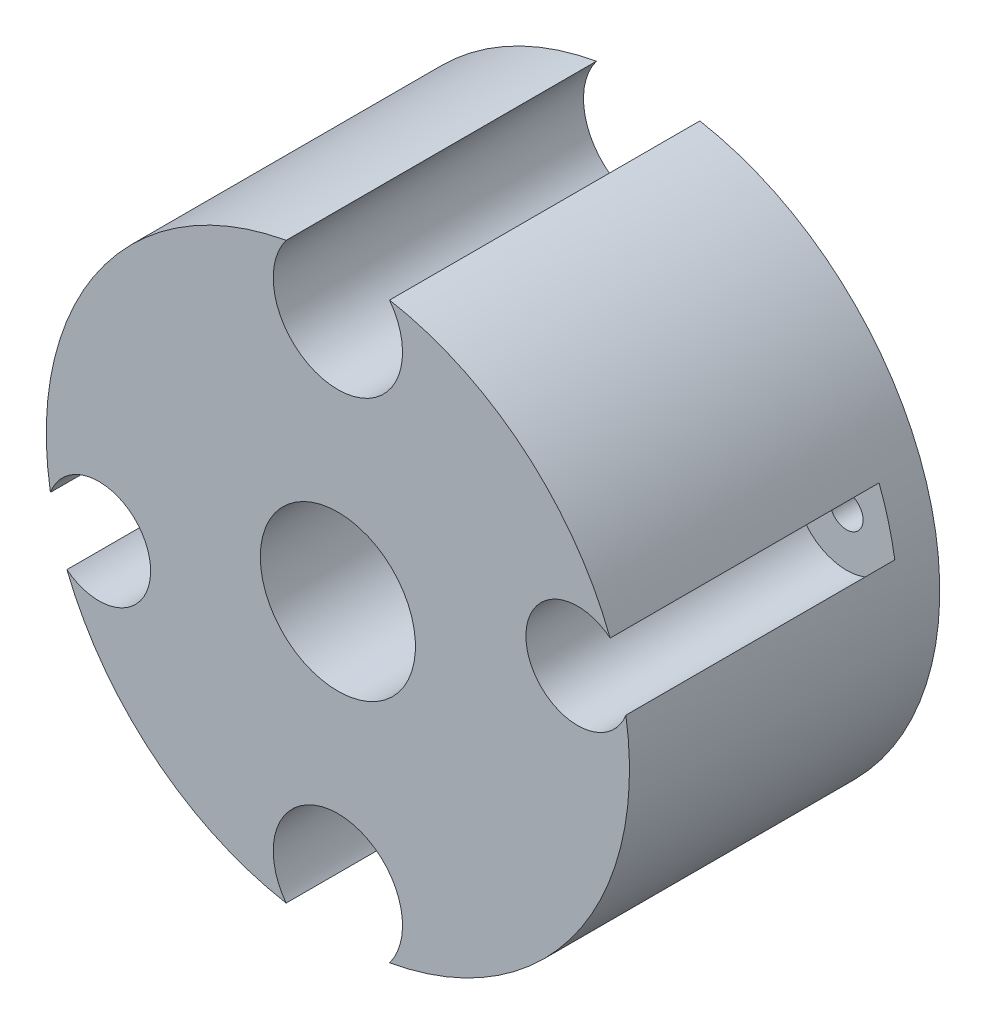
ISO-10303-21;
HEADER;
FILE_DESCRIPTION(('STEP AP214'),'2;1');
FILE_NAME('part.step','',(''),(''),'','','');
FILE_SCHEMA(('AUTOMOTIVE_DESIGN { 1 0 10303 214 1 1 1 1 }'));
ENDSEC;
DATA;
#1=APPLICATION_CONTEXT('core data for automotive mechanical design processes');
#2=APPLICATION_PROTOCOL_DEFINITION('international standard','automotive_design',2000,#1);
#3=PRODUCT_CONTEXT('',#1,'mechanical');
#4=PRODUCT('Part','Part','',(#3));
#5=PRODUCT_RELATED_PRODUCT_CATEGORY('part','',(#4));
#6=PRODUCT_DEFINITION_FORMATION('','',#4);
#7=PRODUCT_DEFINITION_CONTEXT('part definition',#1,'design');
#8=PRODUCT_DEFINITION('design','',#6,#7);
#9=PRODUCT_DEFINITION_SHAPE('','',#8);
#10=(LENGTH_UNIT() NAMED_UNIT(*) SI_UNIT(.MILLI.,.METRE.));
#11=(NAMED_UNIT(*) PLANE_ANGLE_UNIT() SI_UNIT($,.RADIAN.));
#12=(NAMED_UNIT(*) SI_UNIT($,.STERADIAN.) SOLID_ANGLE_UNIT());
#13=UNCERTAINTY_MEASURE_WITH_UNIT(LENGTH_MEASURE(1.E-05),#10,'distance_accuracy_value','');
#14=(GEOMETRIC_REPRESENTATION_CONTEXT(3) GLOBAL_UNCERTAINTY_ASSIGNED_CONTEXT((#13)) GLOBAL_UNIT_ASSIGNED_CONTEXT((#10,
#11,#12)) REPRESENTATION_CONTEXT('',''));
#15=CARTESIAN_POINT('',(0.,0.,0.));
#16=DIRECTION('',(0.,0.,1.));
#17=DIRECTION('',(1.,0.,0.));
#18=AXIS2_PLACEMENT_3D('',#15,#16,#17);
#19=CARTESIAN_POINT('',(0.,0.,19.05));
#20=DIRECTION('',(0.,0.,-1.));
#21=DIRECTION('',(-1.,0.,0.));
#22=AXIS2_PLACEMENT_3D('',#19,#20,#21);
#23=CYLINDRICAL_SURFACE('',#22,4.7625);
#24=CARTESIAN_POINT('',(0.,0.,8.25500000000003));
#25=DIRECTION('',(0.,0.,-1.));
#26=DIRECTION('',(-1.,0.,0.));
#27=AXIS2_PLACEMENT_3D('',#24,#25,#26);
#28=CIRCLE('',#27,4.7625);
#29=CARTESIAN_POINT('',(-4.7625,0.,8.25500000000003));
#30=VERTEX_POINT('',#29);
#31=EDGE_CURVE('E11',#30,#30,#28,.T.);
#32=CARTESIAN_POINT('',(0.,0.,19.05));
#33=DIRECTION('',(0.,0.,1.));
#34=DIRECTION('',(1.,0.,0.));
#35=AXIS2_PLACEMENT_3D('',#32,#33,#34);
#36=CIRCLE('',#35,4.7625);
#37=CARTESIAN_POINT('',(-4.7625,0.,19.05));
#38=VERTEX_POINT('',#37);
#39=EDGE_CURVE('E170',#38,#38,#36,.T.);
#40=CARTESIAN_POINT('',(-4.7625,0.,8.25500000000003));
#41=CARTESIAN_POINT('',(-4.7625,0.,8.3674479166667));
#42=CARTESIAN_POINT('',(-4.7625,0.,8.47989583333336));
#43=CARTESIAN_POINT('',(-4.7625,0.,8.7047916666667));
#44=CARTESIAN_POINT('',(-4.7625,0.,8.81723958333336));
#45=CARTESIAN_POINT('',(-4.7625,0.,9.0421354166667));
#46=CARTESIAN_POINT('',(-4.7625,0.,9.15458333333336));
#47=CARTESIAN_POINT('',(-4.7625,0.,9.37947916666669));
#48=CARTESIAN_POINT('',(-4.7625,0.,9.49192708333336));
#49=CARTESIAN_POINT('',(-4.7625,0.,9.71682291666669));
#50=CARTESIAN_POINT('',(-4.7625,0.,9.82927083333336));
#51=CARTESIAN_POINT('',(-4.7625,0.,10.0541666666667));
#52=CARTESIAN_POINT('',(-4.7625,0.,10.1666145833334));
#53=CARTESIAN_POINT('',(-4.7625,0.,10.3915104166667));
#54=CARTESIAN_POINT('',(-4.7625,0.,10.5039583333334));
#55=CARTESIAN_POINT('',(-4.7625,0.,10.7288541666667));
#56=CARTESIAN_POINT('',(-4.7625,0.,10.8413020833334));
#57=CARTESIAN_POINT('',(-4.7625,0.,11.0661979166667));
#58=CARTESIAN_POINT('',(-4.7625,0.,11.1786458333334));
#59=CARTESIAN_POINT('',(-4.7625,0.,11.4035416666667));
#60=CARTESIAN_POINT('',(-4.7625,0.,11.5159895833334));
#61=CARTESIAN_POINT('',(-4.7625,0.,11.7408854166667));
#62=CARTESIAN_POINT('',(-4.7625,0.,11.8533333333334));
#63=CARTESIAN_POINT('',(-4.7625,0.,12.0782291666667));
#64=CARTESIAN_POINT('',(-4.7625,0.,12.1906770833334));
#65=CARTESIAN_POINT('',(-4.7625,0.,12.4155729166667));
#66=CARTESIAN_POINT('',(-4.7625,0.,12.5280208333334));
#67=CARTESIAN_POINT('',(-4.7625,0.,12.7529166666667));
#68=CARTESIAN_POINT('',(-4.7625,0.,12.8653645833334));
#69=CARTESIAN_POINT('',(-4.7625,0.,13.0902604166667));
#70=CARTESIAN_POINT('',(-4.7625,0.,13.2027083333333));
#71=CARTESIAN_POINT('',(-4.7625,0.,13.4276041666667));
#72=CARTESIAN_POINT('',(-4.7625,0.,13.5400520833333));
#73=CARTESIAN_POINT('',(-4.7625,0.,13.7649479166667));
#74=CARTESIAN_POINT('',(-4.7625,0.,13.8773958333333));
#75=CARTESIAN_POINT('',(-4.7625,0.,14.1022916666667));
#76=CARTESIAN_POINT('',(-4.7625,0.,14.2147395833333));
#77=CARTESIAN_POINT('',(-4.7625,0.,14.4396354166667));
#78=CARTESIAN_POINT('',(-4.7625,0.,14.5520833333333));
#79=CARTESIAN_POINT('',(-4.7625,0.,14.7769791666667));
#80=CARTESIAN_POINT('',(-4.7625,0.,14.8894270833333));
#81=CARTESIAN_POINT('',(-4.7625,0.,15.1143229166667));
#82=CARTESIAN_POINT('',(-4.7625,0.,15.2267708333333));
#83=CARTESIAN_POINT('',(-4.7625,0.,15.4516666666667));
#84=CARTESIAN_POINT('',(-4.7625,0.,15.5641145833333));
#85=CARTESIAN_POINT('',(-4.7625,0.,15.7890104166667));
#86=CARTESIAN_POINT('',(-4.7625,0.,15.9014583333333));
#87=CARTESIAN_POINT('',(-4.7625,0.,16.1263541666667));
#88=CARTESIAN_POINT('',(-4.7625,0.,16.2388020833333));
#89=CARTESIAN_POINT('',(-4.7625,0.,16.4636979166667));
#90=CARTESIAN_POINT('',(-4.7625,0.,16.5761458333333));
#91=CARTESIAN_POINT('',(-4.7625,0.,16.8010416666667));
#92=CARTESIAN_POINT('',(-4.7625,0.,16.9134895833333));
#93=CARTESIAN_POINT('',(-4.7625,0.,17.1383854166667));
#94=CARTESIAN_POINT('',(-4.7625,0.,17.2508333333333));
#95=CARTESIAN_POINT('',(-4.7625,0.,17.4757291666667));
#96=CARTESIAN_POINT('',(-4.7625,0.,17.5881770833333));
#97=CARTESIAN_POINT('',(-4.7625,0.,17.8130729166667));
#98=CARTESIAN_POINT('',(-4.7625,0.,17.9255208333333));
#99=CARTESIAN_POINT('',(-4.7625,0.,18.1504166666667));
#100=CARTESIAN_POINT('',(-4.7625,0.,18.2628645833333));
#101=CARTESIAN_POINT('',(-4.7625,0.,18.4877604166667));
#102=CARTESIAN_POINT('',(-4.7625,0.,18.6002083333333));
#103=CARTESIAN_POINT('',(-4.7625,0.,18.8251041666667));
#104=CARTESIAN_POINT('',(-4.7625,0.,18.9375520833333));
#105=CARTESIAN_POINT('',(-4.7625,0.,19.05));
#106=B_SPLINE_CURVE_WITH_KNOTS('',3,(#40,#41,#42,#43,#44,#45,#46,#47,#48,#49,#50,#51,#52,#53,
#54,#55,#56,#57,#58,#59,#60,#61,#62,#63,#64,#65,#66,#67,#68,#69,#70,#71,#72,#73,#74,#75,#76,#77,
#78,#79,#80,#81,#82,#83,#84,#85,#86,#87,#88,#89,#90,#91,#92,#93,#94,#95,#96,#97,#98,#99,#100,
#101,#102,#103,#104,#105),.UNSPECIFIED.,.F.,.F.,(4,2,2,2,2,2,2,2,2,2,2,2,2,2,2,2,2,2,2,2,2,2,2,
2,2,2,2,2,2,2,2,2,4),(0.,0.337343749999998,0.674687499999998,1.01203125,1.349375,
1.68671874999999,2.02406249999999,2.36140624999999,2.69874999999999,3.03609374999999,
3.37343749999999,3.71078124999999,4.04812499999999,4.38546874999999,4.72281249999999,
5.06015624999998,5.39749999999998,5.73484374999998,6.07218749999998,6.40953124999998,
6.74687499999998,7.08421874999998,7.42156249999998,7.75890624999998,8.09624999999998,
8.43359374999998,8.77093749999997,9.10828124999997,9.44562499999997,9.78296874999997,10.1203125,
10.45765625,10.795),.UNSPECIFIED.);
#107=EDGE_CURVE('BSEAM35',#30,#38,#106,.T.);
#108=ORIENTED_EDGE('',*,*,#31,.T.);
#109=ORIENTED_EDGE('',*,*,#39,.T.);
#110=ORIENTED_EDGE('',*,*,#107,.T.);
#111=ORIENTED_EDGE('',*,*,#107,.F.);
#112=EDGE_LOOP('',(#108,#110,#109,#111));
#113=FACE_BOUND('',#112,.T.);
#114=ADVANCED_FACE('F35',(#113),#23,.F.);
#115=CARTESIAN_POINT('',(14.7207095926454,3.94440224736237,19.05));
#116=DIRECTION('',(0.,0.,-1.));
#117=DIRECTION('',(-1.,0.,0.));
#118=AXIS2_PLACEMENT_3D('',#115,#116,#117);
#119=CYLINDRICAL_SURFACE('',#118,1.016);
#120=CARTESIAN_POINT('',(14.7207095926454,3.94440224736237,0.));
#121=DIRECTION('',(0.,0.,1.));
#122=DIRECTION('',(1.,0.,0.));
#123=AXIS2_PLACEMENT_3D('',#120,#121,#122);
#124=CIRCLE('',#123,1.016);
#125=CARTESIAN_POINT('',(13.7047095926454,3.94440224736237,0.));
#126=VERTEX_POINT('',#125);
#127=EDGE_CURVE('E167',#126,#126,#124,.T.);
#128=CARTESIAN_POINT('',(14.7207095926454,3.94440224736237,2.54));
#129=DIRECTION('',(0.,0.,1.));
#130=DIRECTION('',(1.,0.,0.));
#131=AXIS2_PLACEMENT_3D('',#128,#129,#130);
#132=CIRCLE('',#131,1.016);
#133=CARTESIAN_POINT('',(13.7047095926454,3.94440224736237,2.54));
#134=VERTEX_POINT('',#133);
#135=EDGE_CURVE('E154',#134,#134,#132,.T.);
#136=CARTESIAN_POINT('',(13.7047095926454,3.94440224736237,0.));
#137=CARTESIAN_POINT('',(13.7047095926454,3.94440224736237,0.0264583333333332));
#138=CARTESIAN_POINT('',(13.7047095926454,3.94440224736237,0.0529166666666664));
#139=CARTESIAN_POINT('',(13.7047095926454,3.94440224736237,0.105833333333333));
#140=CARTESIAN_POINT('',(13.7047095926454,3.94440224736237,0.132291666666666));
#141=CARTESIAN_POINT('',(13.7047095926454,3.94440224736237,0.185208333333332));
#142=CARTESIAN_POINT('',(13.7047095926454,3.94440224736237,0.211666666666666));
#143=CARTESIAN_POINT('',(13.7047095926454,3.94440224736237,0.264583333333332));
#144=CARTESIAN_POINT('',(13.7047095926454,3.94440224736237,0.291041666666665));
#145=CARTESIAN_POINT('',(13.7047095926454,3.94440224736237,0.343958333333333));
#146=CARTESIAN_POINT('',(13.7047095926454,3.94440224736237,0.370416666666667));
#147=CARTESIAN_POINT('',(13.7047095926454,3.94440224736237,0.423333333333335));
#148=CARTESIAN_POINT('',(13.7047095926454,3.94440224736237,0.449791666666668));
#149=CARTESIAN_POINT('',(13.7047095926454,3.94440224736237,0.502708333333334));
#150=CARTESIAN_POINT('',(13.7047095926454,3.94440224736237,0.529166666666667));
#151=CARTESIAN_POINT('',(13.7047095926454,3.94440224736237,0.582083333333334));
#152=CARTESIAN_POINT('',(13.7047095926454,3.94440224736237,0.608541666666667));
#153=CARTESIAN_POINT('',(13.7047095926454,3.94440224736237,0.661458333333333));
#154=CARTESIAN_POINT('',(13.7047095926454,3.94440224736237,0.687916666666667));
#155=CARTESIAN_POINT('',(13.7047095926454,3.94440224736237,0.740833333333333));
#156=CARTESIAN_POINT('',(13.7047095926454,3.94440224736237,0.767291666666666));
#157=CARTESIAN_POINT('',(13.7047095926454,3.94440224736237,0.820208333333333));
#158=CARTESIAN_POINT('',(13.7047095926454,3.94440224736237,0.846666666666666));
#159=CARTESIAN_POINT('',(13.7047095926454,3.94440224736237,0.899583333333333));
#160=CARTESIAN_POINT('',(13.7047095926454,3.94440224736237,0.926041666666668));
#161=CARTESIAN_POINT('',(13.7047095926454,3.94440224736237,0.978958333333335));
#162=CARTESIAN_POINT('',(13.7047095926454,3.94440224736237,1.00541666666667));
#163=CARTESIAN_POINT('',(13.7047095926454,3.94440224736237,1.05833333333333));
#164=CARTESIAN_POINT('',(13.7047095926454,3.94440224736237,1.08479166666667));
#165=CARTESIAN_POINT('',(13.7047095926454,3.94440224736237,1.13770833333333));
#166=CARTESIAN_POINT('',(13.7047095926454,3.94440224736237,1.16416666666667));
#167=CARTESIAN_POINT('',(13.7047095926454,3.94440224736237,1.21708333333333));
#168=CARTESIAN_POINT('',(13.7047095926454,3.94440224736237,1.24354166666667));
#169=CARTESIAN_POINT('',(13.7047095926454,3.94440224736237,1.29645833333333));
#170=CARTESIAN_POINT('',(13.7047095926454,3.94440224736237,1.32291666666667));
#171=CARTESIAN_POINT('',(13.7047095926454,3.94440224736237,1.37583333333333));
#172=CARTESIAN_POINT('',(13.7047095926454,3.94440224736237,1.40229166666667));
#173=CARTESIAN_POINT('',(13.7047095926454,3.94440224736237,1.45520833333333));
#174=CARTESIAN_POINT('',(13.7047095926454,3.94440224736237,1.48166666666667));
#175=CARTESIAN_POINT('',(13.7047095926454,3.94440224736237,1.53458333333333));
#176=CARTESIAN_POINT('',(13.7047095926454,3.94440224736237,1.56104166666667));
#177=CARTESIAN_POINT('',(13.7047095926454,3.94440224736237,1.61395833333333));
#178=CARTESIAN_POINT('',(13.7047095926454,3.94440224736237,1.64041666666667));
#179=CARTESIAN_POINT('',(13.7047095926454,3.94440224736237,1.69333333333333));
#180=CARTESIAN_POINT('',(13.7047095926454,3.94440224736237,1.71979166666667));
#181=CARTESIAN_POINT('',(13.7047095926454,3.94440224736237,1.77270833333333));
#182=CARTESIAN_POINT('',(13.7047095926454,3.94440224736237,1.79916666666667));
#183=CARTESIAN_POINT('',(13.7047095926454,3.94440224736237,1.85208333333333));
#184=CARTESIAN_POINT('',(13.7047095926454,3.94440224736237,1.87854166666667));
#185=CARTESIAN_POINT('',(13.7047095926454,3.94440224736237,1.93145833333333));
#186=CARTESIAN_POINT('',(13.7047095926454,3.94440224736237,1.95791666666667));
#187=CARTESIAN_POINT('',(13.7047095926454,3.94440224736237,2.01083333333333));
#188=CARTESIAN_POINT('',(13.7047095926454,3.94440224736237,2.03729166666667));
#189=CARTESIAN_POINT('',(13.7047095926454,3.94440224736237,2.09020833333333));
#190=CARTESIAN_POINT('',(13.7047095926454,3.94440224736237,2.11666666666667));
#191=CARTESIAN_POINT('',(13.7047095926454,3.94440224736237,2.16958333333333));
#192=CARTESIAN_POINT('',(13.7047095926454,3.94440224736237,2.19604166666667));
#193=CARTESIAN_POINT('',(13.7047095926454,3.94440224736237,2.24895833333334));
#194=CARTESIAN_POINT('',(13.7047095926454,3.94440224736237,2.27541666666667));
#195=CARTESIAN_POINT('',(13.7047095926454,3.94440224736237,2.32833333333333));
#196=CARTESIAN_POINT('',(13.7047095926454,3.94440224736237,2.35479166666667));
#197=CARTESIAN_POINT('',(13.7047095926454,3.94440224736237,2.40770833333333));
#198=CARTESIAN_POINT('',(13.7047095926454,3.94440224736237,2.43416666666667));
#199=CARTESIAN_POINT('',(13.7047095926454,3.94440224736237,2.48708333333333));
#200=CARTESIAN_POINT('',(13.7047095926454,3.94440224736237,2.51354166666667));
#201=CARTESIAN_POINT('',(13.7047095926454,3.94440224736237,2.54));
#202=B_SPLINE_CURVE_WITH_KNOTS('',3,(#136,#137,#138,#139,#140,#141,#142,#143,#144,#145,#146,
#147,#148,#149,#150,#151,#152,#153,#154,#155,#156,#157,#158,#159,#160,#161,#162,#163,#164,#165,
#166,#167,#168,#169,#170,#171,#172,#173,#174,#175,#176,#177,#178,#179,#180,#181,#182,#183,#184,
#185,#186,#187,#188,#189,#190,#191,#192,#193,#194,#195,#196,#197,#198,#199,#200,#201),
.UNSPECIFIED.,.F.,.F.,(4,2,2,2,2,2,2,2,2,2,2,2,2,2,2,2,2,2,2,2,2,2,2,2,2,2,2,2,2,2,2,2,4),(0.,
0.0793749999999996,0.158749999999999,0.238124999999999,0.317499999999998,0.396875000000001,
0.476250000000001,0.555625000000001,0.635,0.714375,0.793749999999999,0.873124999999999,
0.952500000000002,1.031875,1.11125,1.190625,1.27,1.349375,1.42875,1.508125,1.5875,1.666875,
1.74625,1.825625,1.905,1.984375,2.06375,2.143125,2.2225,2.301875,2.38125,2.460625,2.54),.UNSPECIFIED.);
#203=EDGE_CURVE('BSEAM212',#126,#134,#202,.T.);
#204=ORIENTED_EDGE('',*,*,#127,.F.);
#205=ORIENTED_EDGE('',*,*,#135,.T.);
#206=ORIENTED_EDGE('',*,*,#203,.T.);
#207=ORIENTED_EDGE('',*,*,#203,.F.);
#208=EDGE_LOOP('',(#204,#206,#205,#207));
#209=FACE_BOUND('',#208,.T.);
#210=ADVANCED_FACE('F212',(#209),#119,.F.);
#211=CARTESIAN_POINT('',(-14.6713946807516,-4.12404875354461,19.05));
#212=DIRECTION('',(0.,0.,-1.));
#213=DIRECTION('',(-1.,0.,0.));
#214=AXIS2_PLACEMENT_3D('',#211,#212,#213);
#215=CYLINDRICAL_SURFACE('',#214,1.016);
#216=CARTESIAN_POINT('',(-14.6713946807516,-4.12404875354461,0.));
#217=DIRECTION('',(0.,0.,1.));
#218=DIRECTION('',(1.,0.,0.));
#219=AXIS2_PLACEMENT_3D('',#216,#217,#218);
#220=CIRCLE('',#219,1.016);
#221=CARTESIAN_POINT('',(-15.6873946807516,-4.12404875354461,0.));
#222=VERTEX_POINT('',#221);
#223=EDGE_CURVE('E164',#222,#222,#220,.T.);
#224=CARTESIAN_POINT('',(-14.6713946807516,-4.12404875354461,2.54));
#225=DIRECTION('',(0.,0.,1.));
#226=DIRECTION('',(1.,0.,0.));
#227=AXIS2_PLACEMENT_3D('',#224,#225,#226);
#228=CIRCLE('',#227,1.016);
#229=CARTESIAN_POINT('',(-15.6873946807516,-4.12404875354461,2.54));
#230=VERTEX_POINT('',#229);
#231=EDGE_CURVE('E146',#230,#230,#228,.T.);
#232=CARTESIAN_POINT('',(-15.6873946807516,-4.12404875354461,0.));
#233=CARTESIAN_POINT('',(-15.6873946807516,-4.12404875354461,0.0264583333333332));
#234=CARTESIAN_POINT('',(-15.6873946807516,-4.12404875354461,0.0529166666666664));
#235=CARTESIAN_POINT('',(-15.6873946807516,-4.12404875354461,0.105833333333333));
#236=CARTESIAN_POINT('',(-15.6873946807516,-4.12404875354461,0.132291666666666));
#237=CARTESIAN_POINT('',(-15.6873946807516,-4.12404875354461,0.185208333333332));
#238=CARTESIAN_POINT('',(-15.6873946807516,-4.12404875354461,0.211666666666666));
#239=CARTESIAN_POINT('',(-15.6873946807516,-4.12404875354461,0.264583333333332));
#240=CARTESIAN_POINT('',(-15.6873946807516,-4.12404875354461,0.291041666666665));
#241=CARTESIAN_POINT('',(-15.6873946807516,-4.12404875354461,0.343958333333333));
#242=CARTESIAN_POINT('',(-15.6873946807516,-4.12404875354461,0.370416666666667));
#243=CARTESIAN_POINT('',(-15.6873946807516,-4.12404875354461,0.423333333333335));
#244=CARTESIAN_POINT('',(-15.6873946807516,-4.12404875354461,0.449791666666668));
#245=CARTESIAN_POINT('',(-15.6873946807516,-4.12404875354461,0.502708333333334));
#246=CARTESIAN_POINT('',(-15.6873946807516,-4.12404875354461,0.529166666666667));
#247=CARTESIAN_POINT('',(-15.6873946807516,-4.12404875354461,0.582083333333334));
#248=CARTESIAN_POINT('',(-15.6873946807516,-4.12404875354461,0.608541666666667));
#249=CARTESIAN_POINT('',(-15.6873946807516,-4.12404875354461,0.661458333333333));
#250=CARTESIAN_POINT('',(-15.6873946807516,-4.12404875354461,0.687916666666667));
#251=CARTESIAN_POINT('',(-15.6873946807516,-4.12404875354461,0.740833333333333));
#252=CARTESIAN_POINT('',(-15.6873946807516,-4.12404875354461,0.767291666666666));
#253=CARTESIAN_POINT('',(-15.6873946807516,-4.12404875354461,0.820208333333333));
#254=CARTESIAN_POINT('',(-15.6873946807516,-4.12404875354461,0.846666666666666));
#255=CARTESIAN_POINT('',(-15.6873946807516,-4.12404875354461,0.899583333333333));
#256=CARTESIAN_POINT('',(-15.6873946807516,-4.12404875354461,0.926041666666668));
#257=CARTESIAN_POINT('',(-15.6873946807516,-4.12404875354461,0.978958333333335));
#258=CARTESIAN_POINT('',(-15.6873946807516,-4.12404875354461,1.00541666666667));
#259=CARTESIAN_POINT('',(-15.6873946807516,-4.12404875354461,1.05833333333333));
#260=CARTESIAN_POINT('',(-15.6873946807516,-4.12404875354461,1.08479166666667));
#261=CARTESIAN_POINT('',(-15.6873946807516,-4.12404875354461,1.13770833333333));
#262=CARTESIAN_POINT('',(-15.6873946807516,-4.12404875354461,1.16416666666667));
#263=CARTESIAN_POINT('',(-15.6873946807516,-4.12404875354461,1.21708333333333));
#264=CARTESIAN_POINT('',(-15.6873946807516,-4.12404875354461,1.24354166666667));
#265=CARTESIAN_POINT('',(-15.6873946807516,-4.12404875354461,1.29645833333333));
#266=CARTESIAN_POINT('',(-15.6873946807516,-4.12404875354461,1.32291666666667));
#267=CARTESIAN_POINT('',(-15.6873946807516,-4.12404875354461,1.37583333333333));
#268=CARTESIAN_POINT('',(-15.6873946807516,-4.12404875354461,1.40229166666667));
#269=CARTESIAN_POINT('',(-15.6873946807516,-4.12404875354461,1.45520833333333));
#270=CARTESIAN_POINT('',(-15.6873946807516,-4.12404875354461,1.48166666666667));
#271=CARTESIAN_POINT('',(-15.6873946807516,-4.12404875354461,1.53458333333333));
#272=CARTESIAN_POINT('',(-15.6873946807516,-4.12404875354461,1.56104166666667));
#273=CARTESIAN_POINT('',(-15.6873946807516,-4.12404875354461,1.61395833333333));
#274=CARTESIAN_POINT('',(-15.6873946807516,-4.12404875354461,1.64041666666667));
#275=CARTESIAN_POINT('',(-15.6873946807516,-4.12404875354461,1.69333333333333));
#276=CARTESIAN_POINT('',(-15.6873946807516,-4.12404875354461,1.71979166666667));
#277=CARTESIAN_POINT('',(-15.6873946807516,-4.12404875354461,1.77270833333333));
#278=CARTESIAN_POINT('',(-15.6873946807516,-4.12404875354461,1.79916666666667));
#279=CARTESIAN_POINT('',(-15.6873946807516,-4.12404875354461,1.85208333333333));
#280=CARTESIAN_POINT('',(-15.6873946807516,-4.12404875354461,1.87854166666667));
#281=CARTESIAN_POINT('',(-15.6873946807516,-4.12404875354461,1.93145833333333));
#282=CARTESIAN_POINT('',(-15.6873946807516,-4.12404875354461,1.95791666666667));
#283=CARTESIAN_POINT('',(-15.6873946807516,-4.12404875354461,2.01083333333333));
#284=CARTESIAN_POINT('',(-15.6873946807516,-4.12404875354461,2.03729166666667));
#285=CARTESIAN_POINT('',(-15.6873946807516,-4.12404875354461,2.09020833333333));
#286=CARTESIAN_POINT('',(-15.6873946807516,-4.12404875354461,2.11666666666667));
#287=CARTESIAN_POINT('',(-15.6873946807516,-4.12404875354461,2.16958333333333));
#288=CARTESIAN_POINT('',(-15.6873946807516,-4.12404875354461,2.19604166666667));
#289=CARTESIAN_POINT('',(-15.6873946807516,-4.12404875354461,2.24895833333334));
#290=CARTESIAN_POINT('',(-15.6873946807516,-4.12404875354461,2.27541666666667));
#291=CARTESIAN_POINT('',(-15.6873946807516,-4.12404875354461,2.32833333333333));
#292=CARTESIAN_POINT('',(-15.6873946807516,-4.12404875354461,2.35479166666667));
#293=CARTESIAN_POINT('',(-15.6873946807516,-4.12404875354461,2.40770833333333));
#294=CARTESIAN_POINT('',(-15.6873946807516,-4.12404875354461,2.43416666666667));
#295=CARTESIAN_POINT('',(-15.6873946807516,-4.12404875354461,2.48708333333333));
#296=CARTESIAN_POINT('',(-15.6873946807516,-4.12404875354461,2.51354166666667));
#297=CARTESIAN_POINT('',(-15.6873946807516,-4.12404875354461,2.54));
#298=B_SPLINE_CURVE_WITH_KNOTS('',3,(#232,#233,#234,#235,#236,#237,#238,#239,#240,#241,#242,
#243,#244,#245,#246,#247,#248,#249,#250,#251,#252,#253,#254,#255,#256,#257,#258,#259,#260,#261,
#262,#263,#264,#265,#266,#267,#268,#269,#270,#271,#272,#273,#274,#275,#276,#277,#278,#279,#280,
#281,#282,#283,#284,#285,#286,#287,#288,#289,#290,#291,#292,#293,#294,#295,#296,#297),
.UNSPECIFIED.,.F.,.F.,(4,2,2,2,2,2,2,2,2,2,2,2,2,2,2,2,2,2,2,2,2,2,2,2,2,2,2,2,2,2,2,2,4),(0.,
0.0793749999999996,0.158749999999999,0.238124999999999,0.317499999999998,0.396875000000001,
0.476250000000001,0.555625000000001,0.635,0.714375,0.793749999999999,0.873124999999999,
0.952500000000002,1.031875,1.11125,1.190625,1.27,1.349375,1.42875,1.508125,1.5875,1.666875,
1.74625,1.825625,1.905,1.984375,2.06375,2.143125,2.2225,2.301875,2.38125,2.460625,2.54),.UNSPECIFIED.);
#299=EDGE_CURVE('BSEAM218',#222,#230,#298,.T.);
#300=ORIENTED_EDGE('',*,*,#223,.F.);
#301=ORIENTED_EDGE('',*,*,#231,.T.);
#302=ORIENTED_EDGE('',*,*,#299,.T.);
#303=ORIENTED_EDGE('',*,*,#299,.F.);
#304=EDGE_LOOP('',(#300,#302,#301,#303));
#305=FACE_BOUND('',#304,.T.);
#306=ADVANCED_FACE('F218',(#305),#215,.F.);
#307=CARTESIAN_POINT('',(0.,-7.61963025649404,19.05));
#308=DIRECTION('',(0.,0.,1.));
#309=DIRECTION('',(1.,0.,0.));
#310=AXIS2_PLACEMENT_3D('',#307,#308,#309);
#311=PLANE('',#310);
#312=CARTESIAN_POINT('',(14.7207095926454,3.94440224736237,19.05));
#313=DIRECTION('',(0.,0.,1.));
#314=DIRECTION('',(1.,0.,0.));
#315=AXIS2_PLACEMENT_3D('',#312,#313,#314);
#316=CIRCLE('',#315,3.175);
#317=CARTESIAN_POINT('',(16.7158956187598,6.41419125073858,19.05));
#318=VERTEX_POINT('',#317);
#319=CARTESIAN_POINT('',(17.6834858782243,2.80309524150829,19.05));
#320=VERTEX_POINT('',#319);
#321=EDGE_CURVE('E102',#318,#320,#316,.T.);
#322=ORIENTED_EDGE('',*,*,#321,.F.);
#323=CARTESIAN_POINT('',(0.,0.,19.05));
#324=DIRECTION('',(0.,0.,1.));
#325=DIRECTION('',(1.,0.,0.));
#326=AXIS2_PLACEMENT_3D('',#323,#324,#325);
#327=CIRCLE('',#326,17.9042736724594);
#328=CARTESIAN_POINT('',(3.17500000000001,17.6205105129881,19.05));
#329=VERTEX_POINT('',#328);
#330=EDGE_CURVE('E113',#318,#329,#327,.T.);
#331=ORIENTED_EDGE('',*,*,#330,.T.);
#332=CARTESIAN_POINT('',(0.,15.2392605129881,19.05));
#333=DIRECTION('',(0.,0.,-1.));
#334=DIRECTION('',(1.,0.,0.));
#335=AXIS2_PLACEMENT_3D('',#332,#333,#334);
#336=CIRCLE('',#335,3.96875);
#337=CARTESIAN_POINT('',(-3.175,17.6205105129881,19.05));
#338=VERTEX_POINT('',#337);
#339=EDGE_CURVE('E125',#329,#338,#336,.T.);
#340=ORIENTED_EDGE('',*,*,#339,.T.);
#341=CARTESIAN_POINT('',(0.,0.,19.05));
#342=DIRECTION('',(0.,0.,1.));
#343=DIRECTION('',(1.,0.,0.));
#344=AXIS2_PLACEMENT_3D('',#341,#342,#343);
#345=CIRCLE('',#344,17.9042736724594);
#346=CARTESIAN_POINT('',(-17.6479005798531,-3.01904303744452,19.05));
#347=VERTEX_POINT('',#346);
#348=EDGE_CURVE('E132',#338,#347,#345,.T.);
#349=ORIENTED_EDGE('',*,*,#348,.T.);
#350=CARTESIAN_POINT('',(-14.6713946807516,-4.12404875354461,19.05));
#351=DIRECTION('',(0.,0.,1.));
#352=DIRECTION('',(1.,0.,0.));
#353=AXIS2_PLACEMENT_3D('',#350,#351,#352);
#354=CIRCLE('',#353,3.175);
#355=CARTESIAN_POINT('',(-16.6362417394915,-6.6180417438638,19.05));
#356=VERTEX_POINT('',#355);
#357=EDGE_CURVE('E157',#356,#347,#354,.T.);
#358=ORIENTED_EDGE('',*,*,#357,.F.);
#359=CARTESIAN_POINT('',(-3.17500000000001,-17.6205105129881,19.05));
#360=VERTEX_POINT('',#359);
#361=EDGE_CURVE('E131',#356,#360,#345,.T.);
#362=ORIENTED_EDGE('',*,*,#361,.T.);
#363=CARTESIAN_POINT('',(0.,-15.2392605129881,19.05));
#364=DIRECTION('',(0.,0.,-1.));
#365=DIRECTION('',(1.,0.,0.));
#366=AXIS2_PLACEMENT_3D('',#363,#364,#365);
#367=CIRCLE('',#366,3.96875);
#368=CARTESIAN_POINT('',(3.175,-17.6205105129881,19.05));
#369=VERTEX_POINT('',#368);
#370=EDGE_CURVE('E123',#360,#369,#367,.T.);
#371=ORIENTED_EDGE('',*,*,#370,.T.);
#372=EDGE_CURVE('E116',#369,#320,#327,.T.);
#373=ORIENTED_EDGE('',*,*,#372,.T.);
#374=EDGE_LOOP('',(#322,#331,#340,#349,#358,#362,#371,#373));
#375=FACE_BOUND('',#374,.T.);
#376=ORIENTED_EDGE('',*,*,#39,.F.);
#377=EDGE_LOOP('',(#376));
#378=FACE_BOUND('',#377,.T.);
#379=ADVANCED_FACE('F111',(#375,#378),#311,.T.);
#380=CARTESIAN_POINT('',(0.,-7.61963025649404,0.));
#381=DIRECTION('',(0.,0.,1.));
#382=DIRECTION('',(1.,0.,0.));
#383=AXIS2_PLACEMENT_3D('',#380,#381,#382);
#384=PLANE('',#383);
#385=CARTESIAN_POINT('',(0.,0.,0.));
#386=DIRECTION('',(0.,0.,-1.));
#387=DIRECTION('',(-1.,0.,0.));
#388=AXIS2_PLACEMENT_3D('',#385,#386,#387);
#389=CIRCLE('',#388,7.9375);
#390=CARTESIAN_POINT('',(-7.9375,0.,0.));
#391=VERTEX_POINT('',#390);
#392=EDGE_CURVE('E335',#391,#391,#389,.T.);
#393=ORIENTED_EDGE('',*,*,#392,.F.);
#394=EDGE_LOOP('',(#393));
#395=FACE_BOUND('',#394,.T.);
#396=ORIENTED_EDGE('',*,*,#127,.T.);
#397=EDGE_LOOP('',(#396));
#398=FACE_BOUND('',#397,.T.);
#399=CARTESIAN_POINT('',(0.,-15.2392605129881,0.));
#400=DIRECTION('',(0.,0.,-1.));
#401=DIRECTION('',(1.,0.,0.));
#402=AXIS2_PLACEMENT_3D('',#399,#400,#401);
#403=CIRCLE('',#402,3.96875);
#404=CARTESIAN_POINT('',(-3.17500000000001,-17.6205105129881,0.));
#405=VERTEX_POINT('',#404);
#406=CARTESIAN_POINT('',(3.175,-17.6205105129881,0.));
#407=VERTEX_POINT('',#406);
#408=EDGE_CURVE('E173',#405,#407,#403,.T.);
#409=ORIENTED_EDGE('',*,*,#408,.F.);
#410=CARTESIAN_POINT('',(0.,0.,0.));
#411=DIRECTION('',(0.,0.,1.));
#412=DIRECTION('',(1.,0.,0.));
#413=AXIS2_PLACEMENT_3D('',#410,#411,#412);
#414=CIRCLE('',#413,17.9042736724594);
#415=CARTESIAN_POINT('',(-3.175,17.6205105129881,0.));
#416=VERTEX_POINT('',#415);
#417=EDGE_CURVE('E126',#416,#405,#414,.T.);
#418=ORIENTED_EDGE('',*,*,#417,.F.);
#419=CARTESIAN_POINT('',(0.,15.2392605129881,0.));
#420=DIRECTION('',(0.,0.,-1.));
#421=DIRECTION('',(1.,0.,0.));
#422=AXIS2_PLACEMENT_3D('',#419,#420,#421);
#423=CIRCLE('',#422,3.96875);
#424=CARTESIAN_POINT('',(3.17500000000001,17.6205105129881,0.));
#425=VERTEX_POINT('',#424);
#426=EDGE_CURVE('E178',#425,#416,#423,.T.);
#427=ORIENTED_EDGE('',*,*,#426,.F.);
#428=CARTESIAN_POINT('',(0.,0.,0.));
#429=DIRECTION('',(0.,0.,1.));
#430=DIRECTION('',(1.,0.,0.));
#431=AXIS2_PLACEMENT_3D('',#428,#429,#430);
#432=CIRCLE('',#431,17.9042736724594);
#433=EDGE_CURVE('E176',#407,#425,#432,.T.);
#434=ORIENTED_EDGE('',*,*,#433,.F.);
#435=EDGE_LOOP('',(#409,#418,#427,#434));
#436=FACE_BOUND('',#435,.T.);
#437=ORIENTED_EDGE('',*,*,#223,.T.);
#438=EDGE_LOOP('',(#437));
#439=FACE_BOUND('',#438,.T.);
#440=ADVANCED_FACE('F193',(#395,#398,#436,#439),#384,.F.);
#441=CARTESIAN_POINT('',(0.,-15.2392605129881,19.05));
#442=DIRECTION('',(0.,0.,-1.));
#443=DIRECTION('',(-1.,0.,0.));
#444=AXIS2_PLACEMENT_3D('',#441,#442,#443);
#445=CYLINDRICAL_SURFACE('',#444,3.96875);
#446=ORIENTED_EDGE('',*,*,#408,.T.);
#447=DIRECTION('',(0.,0.,-1.));
#448=VECTOR('',#447,1.);
#449=CARTESIAN_POINT('',(3.175,-17.6205105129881,19.05));
#450=LINE('',#449,#448);
#451=EDGE_CURVE('E142',#369,#407,#450,.T.);
#452=ORIENTED_EDGE('',*,*,#451,.F.);
#453=ORIENTED_EDGE('',*,*,#370,.F.);
#454=DIRECTION('',(0.,0.,-1.));
#455=VECTOR('',#454,1.);
#456=CARTESIAN_POINT('',(-3.17500000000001,-17.6205105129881,19.05));
#457=LINE('',#456,#455);
#458=EDGE_CURVE('E135',#360,#405,#457,.T.);
#459=ORIENTED_EDGE('',*,*,#458,.T.);
#460=EDGE_LOOP('',(#446,#452,#453,#459));
#461=FACE_BOUND('',#460,.T.);
#462=ADVANCED_FACE('F37',(#461),#445,.F.);
#463=CARTESIAN_POINT('',(0.,0.,19.05));
#464=DIRECTION('',(0.,0.,-1.));
#465=DIRECTION('',(-1.,0.,0.));
#466=AXIS2_PLACEMENT_3D('',#463,#464,#465);
#467=CYLINDRICAL_SURFACE('',#466,17.9042736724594);
#468=CARTESIAN_POINT('',(0.,0.,2.54));
#469=DIRECTION('',(0.,0.,1.));
#470=DIRECTION('',(1.,0.,0.));
#471=AXIS2_PLACEMENT_3D('',#468,#469,#470);
#472=CIRCLE('',#471,17.9042736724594);
#473=CARTESIAN_POINT('',(17.6834858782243,2.80309524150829,2.54));
#474=VERTEX_POINT('',#473);
#475=CARTESIAN_POINT('',(16.7158956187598,6.41419125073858,2.54));
#476=VERTEX_POINT('',#475);
#477=EDGE_CURVE('E156',#474,#476,#472,.T.);
#478=ORIENTED_EDGE('',*,*,#477,.F.);
#479=DIRECTION('',(0.,0.,1.));
#480=VECTOR('',#479,1.);
#481=CARTESIAN_POINT('',(17.6834858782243,2.80309524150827,10.795));
#482=LINE('',#481,#480);
#483=EDGE_CURVE('E43',#474,#320,#482,.T.);
#484=ORIENTED_EDGE('',*,*,#483,.T.);
#485=ORIENTED_EDGE('',*,*,#372,.F.);
#486=ORIENTED_EDGE('',*,*,#451,.T.);
#487=ORIENTED_EDGE('',*,*,#433,.T.);
#488=DIRECTION('',(0.,0.,-1.));
#489=VECTOR('',#488,1.);
#490=CARTESIAN_POINT('',(3.17500000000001,17.6205105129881,19.05));
#491=LINE('',#490,#489);
#492=EDGE_CURVE('E121',#329,#425,#491,.T.);
#493=ORIENTED_EDGE('',*,*,#492,.F.);
#494=ORIENTED_EDGE('',*,*,#330,.F.);
#495=DIRECTION('',(0.,0.,1.));
#496=VECTOR('',#495,1.);
#497=CARTESIAN_POINT('',(16.7158956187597,6.41419125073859,10.795));
#498=LINE('',#497,#496);
#499=EDGE_CURVE('E99',#318,#476,#498,.F.);
#500=ORIENTED_EDGE('',*,*,#499,.T.);
#501=EDGE_LOOP('',(#478,#484,#485,#486,#487,#493,#494,#500));
#502=FACE_BOUND('',#501,.T.);
#503=ADVANCED_FACE('F119',(#502),#467,.T.);
#504=CARTESIAN_POINT('',(0.,15.2392605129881,19.05));
#505=DIRECTION('',(0.,0.,-1.));
#506=DIRECTION('',(-1.,0.,0.));
#507=AXIS2_PLACEMENT_3D('',#504,#505,#506);
#508=CYLINDRICAL_SURFACE('',#507,3.96875);
#509=ORIENTED_EDGE('',*,*,#426,.T.);
#510=DIRECTION('',(0.,0.,-1.));
#511=VECTOR('',#510,1.);
#512=CARTESIAN_POINT('',(-3.175,17.6205105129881,19.05));
#513=LINE('',#512,#511);
#514=EDGE_CURVE('E138',#338,#416,#513,.T.);
#515=ORIENTED_EDGE('',*,*,#514,.F.);
#516=ORIENTED_EDGE('',*,*,#339,.F.);
#517=ORIENTED_EDGE('',*,*,#492,.T.);
#518=EDGE_LOOP('',(#509,#515,#516,#517));
#519=FACE_BOUND('',#518,.T.);
#520=ADVANCED_FACE('F196',(#519),#508,.F.);
#521=CARTESIAN_POINT('',(0.,0.,19.05));
#522=DIRECTION('',(0.,0.,-1.));
#523=DIRECTION('',(-1.,0.,0.));
#524=AXIS2_PLACEMENT_3D('',#521,#522,#523);
#525=CYLINDRICAL_SURFACE('',#524,17.9042736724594);
#526=CARTESIAN_POINT('',(0.,0.,2.54));
#527=DIRECTION('',(0.,0.,1.));
#528=DIRECTION('',(1.,0.,0.));
#529=AXIS2_PLACEMENT_3D('',#526,#527,#528);
#530=CIRCLE('',#529,17.9042736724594);
#531=CARTESIAN_POINT('',(-17.6479005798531,-3.01904303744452,2.54));
#532=VERTEX_POINT('',#531);
#533=CARTESIAN_POINT('',(-16.6362417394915,-6.6180417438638,2.54));
#534=VERTEX_POINT('',#533);
#535=EDGE_CURVE('E149',#532,#534,#530,.T.);
#536=ORIENTED_EDGE('',*,*,#535,.F.);
#537=DIRECTION('',(0.,0.,1.));
#538=VECTOR('',#537,1.);
#539=CARTESIAN_POINT('',(-17.6479005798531,-3.01904303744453,10.795));
#540=LINE('',#539,#538);
#541=EDGE_CURVE('E107',#532,#347,#540,.T.);
#542=ORIENTED_EDGE('',*,*,#541,.T.);
#543=ORIENTED_EDGE('',*,*,#348,.F.);
#544=ORIENTED_EDGE('',*,*,#514,.T.);
#545=ORIENTED_EDGE('',*,*,#417,.T.);
#546=ORIENTED_EDGE('',*,*,#458,.F.);
#547=ORIENTED_EDGE('',*,*,#361,.F.);
#548=DIRECTION('',(0.,0.,1.));
#549=VECTOR('',#548,1.);
#550=CARTESIAN_POINT('',(-16.6362417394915,-6.61804174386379,10.795));
#551=LINE('',#550,#549);
#552=EDGE_CURVE('E145',#356,#534,#551,.F.);
#553=ORIENTED_EDGE('',*,*,#552,.T.);
#554=EDGE_LOOP('',(#536,#542,#543,#544,#545,#546,#547,#553));
#555=FACE_BOUND('',#554,.T.);
#556=ADVANCED_FACE('F183',(#555),#525,.T.);
#557=CARTESIAN_POINT('',(-14.6713946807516,-4.12404875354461,2.54));
#558=DIRECTION('',(0.,0.,1.));
#559=DIRECTION('',(1.,0.,0.));
#560=AXIS2_PLACEMENT_3D('',#557,#558,#559);
#561=CYLINDRICAL_SURFACE('',#560,3.175);
#562=CARTESIAN_POINT('',(-14.6713946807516,-4.12404875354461,2.54));
#563=DIRECTION('',(0.,0.,1.));
#564=DIRECTION('',(1.,0.,0.));
#565=AXIS2_PLACEMENT_3D('',#562,#563,#564);
#566=CIRCLE('',#565,3.175);
#567=EDGE_CURVE('E56',#534,#532,#566,.T.);
#568=ORIENTED_EDGE('',*,*,#567,.F.);
#569=ORIENTED_EDGE('',*,*,#552,.F.);
#570=ORIENTED_EDGE('',*,*,#357,.T.);
#571=ORIENTED_EDGE('',*,*,#541,.F.);
#572=EDGE_LOOP('',(#568,#569,#570,#571));
#573=FACE_BOUND('',#572,.T.);
#574=ADVANCED_FACE('F199',(#573),#561,.F.);
#575=CARTESIAN_POINT('',(-14.6713946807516,-4.12404875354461,2.54));
#576=DIRECTION('',(0.,0.,1.));
#577=DIRECTION('',(1.,0.,0.));
#578=AXIS2_PLACEMENT_3D('',#575,#576,#577);
#579=PLANE('',#578);
#580=ORIENTED_EDGE('',*,*,#231,.F.);
#581=EDGE_LOOP('',(#580));
#582=FACE_BOUND('',#581,.T.);
#583=ORIENTED_EDGE('',*,*,#535,.T.);
#584=ORIENTED_EDGE('',*,*,#567,.T.);
#585=EDGE_LOOP('',(#583,#584));
#586=FACE_BOUND('',#585,.T.);
#587=ADVANCED_FACE('F201',(#582,#586),#579,.T.);
#588=CARTESIAN_POINT('',(14.7207095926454,3.94440224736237,2.54));
#589=DIRECTION('',(0.,0.,1.));
#590=DIRECTION('',(1.,0.,0.));
#591=AXIS2_PLACEMENT_3D('',#588,#589,#590);
#592=CYLINDRICAL_SURFACE('',#591,3.175);
#593=CARTESIAN_POINT('',(14.7207095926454,3.94440224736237,2.54));
#594=DIRECTION('',(0.,0.,1.));
#595=DIRECTION('',(1.,0.,0.));
#596=AXIS2_PLACEMENT_3D('',#593,#594,#595);
#597=CIRCLE('',#596,3.175);
#598=EDGE_CURVE('E49',#476,#474,#597,.T.);
#599=ORIENTED_EDGE('',*,*,#598,.F.);
#600=ORIENTED_EDGE('',*,*,#499,.F.);
#601=ORIENTED_EDGE('',*,*,#321,.T.);
#602=ORIENTED_EDGE('',*,*,#483,.F.);
#603=EDGE_LOOP('',(#599,#600,#601,#602));
#604=FACE_BOUND('',#603,.T.);
#605=ADVANCED_FACE('F101',(#604),#592,.F.);
#606=CARTESIAN_POINT('',(14.7207095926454,3.94440224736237,2.54));
#607=DIRECTION('',(0.,0.,1.));
#608=DIRECTION('',(1.,0.,0.));
#609=AXIS2_PLACEMENT_3D('',#606,#607,#608);
#610=PLANE('',#609);
#611=ORIENTED_EDGE('',*,*,#135,.F.);
#612=EDGE_LOOP('',(#611));
#613=FACE_BOUND('',#612,.T.);
#614=ORIENTED_EDGE('',*,*,#477,.T.);
#615=ORIENTED_EDGE('',*,*,#598,.T.);
#616=EDGE_LOOP('',(#614,#615));
#617=FACE_BOUND('',#616,.T.);
#618=ADVANCED_FACE('F295',(#613,#617),#610,.T.);
#619=CARTESIAN_POINT('',(0.,0.,5.08));
#620=DIRECTION('',(0.,0.,-1.));
#621=DIRECTION('',(-1.,0.,0.));
#622=AXIS2_PLACEMENT_3D('',#619,#620,#621);
#623=CYLINDRICAL_SURFACE('',#622,7.9375);
#624=CARTESIAN_POINT('',(0.,0.,5.08));
#625=DIRECTION('',(0.,0.,-1.));
#626=DIRECTION('',(-1.,0.,0.));
#627=AXIS2_PLACEMENT_3D('',#624,#625,#626);
#628=CIRCLE('',#627,7.9375);
#629=CARTESIAN_POINT('',(-7.9375,0.,5.08));
#630=VERTEX_POINT('',#629);
#631=EDGE_CURVE('E117',#630,#630,#628,.T.);
#632=ORIENTED_EDGE('',*,*,#631,.F.);
#633=EDGE_LOOP('',(#632));
#634=FACE_BOUND('',#633,.T.);
#635=ORIENTED_EDGE('',*,*,#392,.T.);
#636=EDGE_LOOP('',(#635));
#637=FACE_BOUND('',#636,.T.);
#638=ADVANCED_FACE('F303',(#634,#637),#623,.F.);
#639=CARTESIAN_POINT('',(0.,0.,8.25500000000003));
#640=DIRECTION('',(0.,0.,-1.));
#641=DIRECTION('',(-1.,0.,0.));
#642=AXIS2_PLACEMENT_3D('',#639,#640,#641);
#643=CONICAL_SURFACE('',#642,4.7625,0.78539816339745);
#644=ORIENTED_EDGE('',*,*,#631,.T.);
#645=EDGE_LOOP('',(#644));
#646=FACE_BOUND('',#645,.T.);
#647=ORIENTED_EDGE('',*,*,#31,.F.);
#648=EDGE_LOOP('',(#647));
#649=FACE_BOUND('',#648,.T.);
#650=ADVANCED_FACE('F313',(#646,#649),#643,.F.);
#651=CLOSED_SHELL('',(#114,#210,#306,#379,#440,#462,#503,#520,#556,#574,#587,#605,#618,#638,#650));
#652=MANIFOLD_SOLID_BREP('B2',#651);
#653=ADVANCED_BREP_SHAPE_REPRESENTATION('',(#18,#652),#14);
#654=SHAPE_DEFINITION_REPRESENTATION(#9,#653);
ENDSEC;
END-ISO-10303-21;
